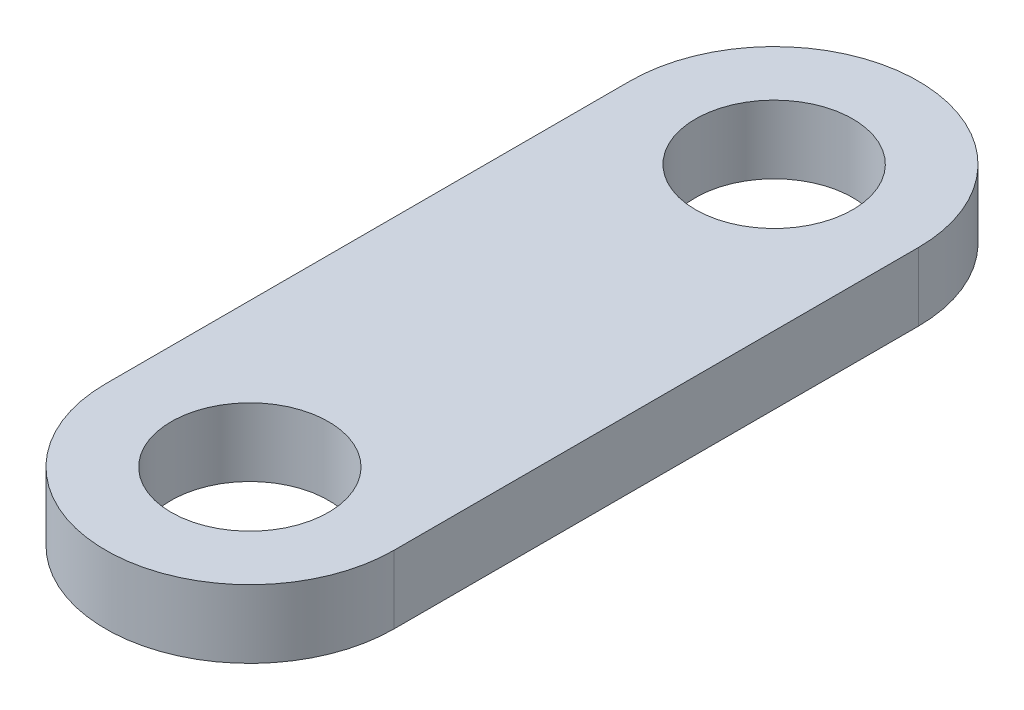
ISO-10303-21;
HEADER;
FILE_DESCRIPTION(('STEP AP214'),'2;1');
FILE_NAME('part.step','',(''),(''),'','','');
FILE_SCHEMA(('AUTOMOTIVE_DESIGN { 1 0 10303 214 1 1 1 1 }'));
ENDSEC;
DATA;
#1=APPLICATION_CONTEXT('core data for automotive mechanical design processes');
#2=APPLICATION_PROTOCOL_DEFINITION('international standard','automotive_design',2000,#1);
#3=PRODUCT_CONTEXT('',#1,'mechanical');
#4=PRODUCT('Part','Part','',(#3));
#5=PRODUCT_RELATED_PRODUCT_CATEGORY('part','',(#4));
#6=PRODUCT_DEFINITION_FORMATION('','',#4);
#7=PRODUCT_DEFINITION_CONTEXT('part definition',#1,'design');
#8=PRODUCT_DEFINITION('design','',#6,#7);
#9=PRODUCT_DEFINITION_SHAPE('','',#8);
#10=(LENGTH_UNIT() NAMED_UNIT(*) SI_UNIT(.MILLI.,.METRE.));
#11=(NAMED_UNIT(*) PLANE_ANGLE_UNIT() SI_UNIT($,.RADIAN.));
#12=(NAMED_UNIT(*) SI_UNIT($,.STERADIAN.) SOLID_ANGLE_UNIT());
#13=UNCERTAINTY_MEASURE_WITH_UNIT(LENGTH_MEASURE(1.E-05),#10,'distance_accuracy_value','');
#14=(GEOMETRIC_REPRESENTATION_CONTEXT(3) GLOBAL_UNCERTAINTY_ASSIGNED_CONTEXT((#13)) GLOBAL_UNIT_ASSIGNED_CONTEXT((#10,
#11,#12)) REPRESENTATION_CONTEXT('',''));
#15=CARTESIAN_POINT('',(0.,0.,0.));
#16=DIRECTION('',(0.,0.,1.));
#17=DIRECTION('',(1.,0.,0.));
#18=AXIS2_PLACEMENT_3D('',#15,#16,#17);
#19=CARTESIAN_POINT('',(0.,2.6,-10.2603383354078));
#20=DIRECTION('',(0.,1.,0.));
#21=DIRECTION('',(0.,0.,1.));
#22=AXIS2_PLACEMENT_3D('',#19,#20,#21);
#23=PLANE('',#22);
#24=CARTESIAN_POINT('',(0.,2.6,-10.2603383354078));
#25=DIRECTION('',(0.,1.,0.));
#26=DIRECTION('',(0.,0.,1.));
#27=AXIS2_PLACEMENT_3D('',#24,#25,#26);
#28=CIRCLE('',#27,3.);
#29=CARTESIAN_POINT('',(0.,2.6,-7.26033833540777));
#30=VERTEX_POINT('',#29);
#31=EDGE_CURVE('E117',#30,#30,#28,.T.);
#32=ORIENTED_EDGE('',*,*,#31,.F.);
#33=EDGE_LOOP('',(#32));
#34=FACE_BOUND('',#33,.T.);
#35=CARTESIAN_POINT('',(0.,2.6,-10.2603383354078));
#36=DIRECTION('',(0.,1.,0.));
#37=DIRECTION('',(0.,0.,1.));
#38=AXIS2_PLACEMENT_3D('',#35,#36,#37);
#39=CIRCLE('',#38,5.5);
#40=CARTESIAN_POINT('',(5.5,2.6,-10.2603383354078));
#41=VERTEX_POINT('',#40);
#42=CARTESIAN_POINT('',(-5.5,2.6,-10.2603383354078));
#43=VERTEX_POINT('',#42);
#44=EDGE_CURVE('E98',#41,#43,#39,.T.);
#45=ORIENTED_EDGE('',*,*,#44,.T.);
#46=DIRECTION('',(0.,0.,1.));
#47=VECTOR('',#46,1.);
#48=CARTESIAN_POINT('',(-5.5,2.6,-10.2603383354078));
#49=LINE('',#48,#47);
#50=CARTESIAN_POINT('',(-5.5,2.6,9.73966166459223));
#51=VERTEX_POINT('',#50);
#52=EDGE_CURVE('E91',#43,#51,#49,.T.);
#53=ORIENTED_EDGE('',*,*,#52,.T.);
#54=CARTESIAN_POINT('',(0.,2.6,9.73966166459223));
#55=DIRECTION('',(0.,1.,0.));
#56=DIRECTION('',(0.,0.,1.));
#57=AXIS2_PLACEMENT_3D('',#54,#55,#56);
#58=CIRCLE('',#57,5.5);
#59=CARTESIAN_POINT('',(5.5,2.6,9.73966166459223));
#60=VERTEX_POINT('',#59);
#61=EDGE_CURVE('E96',#51,#60,#58,.T.);
#62=ORIENTED_EDGE('',*,*,#61,.T.);
#63=DIRECTION('',(0.,0.,-1.));
#64=VECTOR('',#63,1.);
#65=CARTESIAN_POINT('',(5.5,2.6,9.73966166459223));
#66=LINE('',#65,#64);
#67=EDGE_CURVE('E62',#60,#41,#66,.T.);
#68=ORIENTED_EDGE('',*,*,#67,.T.);
#69=EDGE_LOOP('',(#45,#53,#62,#68));
#70=FACE_BOUND('',#69,.T.);
#71=CARTESIAN_POINT('',(0.,2.6,9.73966166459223));
#72=DIRECTION('',(0.,1.,0.));
#73=DIRECTION('',(0.,0.,1.));
#74=AXIS2_PLACEMENT_3D('',#71,#72,#73);
#75=CIRCLE('',#74,3.);
#76=CARTESIAN_POINT('',(0.,2.6,12.7396616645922));
#77=VERTEX_POINT('',#76);
#78=EDGE_CURVE('E138',#77,#77,#75,.T.);
#79=ORIENTED_EDGE('',*,*,#78,.F.);
#80=EDGE_LOOP('',(#79));
#81=FACE_BOUND('',#80,.T.);
#82=ADVANCED_FACE('F44',(#34,#70,#81),#23,.T.);
#83=CARTESIAN_POINT('',(0.,0.,-10.2603383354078));
#84=DIRECTION('',(0.,1.,0.));
#85=DIRECTION('',(0.,0.,1.));
#86=AXIS2_PLACEMENT_3D('',#83,#84,#85);
#87=PLANE('',#86);
#88=CARTESIAN_POINT('',(0.,0.,-10.2603383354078));
#89=DIRECTION('',(0.,1.,0.));
#90=DIRECTION('',(0.,0.,1.));
#91=AXIS2_PLACEMENT_3D('',#88,#89,#90);
#92=CIRCLE('',#91,5.5);
#93=CARTESIAN_POINT('',(5.5,0.,-10.2603383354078));
#94=VERTEX_POINT('',#93);
#95=CARTESIAN_POINT('',(-5.5,0.,-10.2603383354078));
#96=VERTEX_POINT('',#95);
#97=EDGE_CURVE('E111',#94,#96,#92,.T.);
#98=ORIENTED_EDGE('',*,*,#97,.F.);
#99=DIRECTION('',(0.,0.,-1.));
#100=VECTOR('',#99,1.);
#101=CARTESIAN_POINT('',(5.5,0.,9.73966166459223));
#102=LINE('',#101,#100);
#103=CARTESIAN_POINT('',(5.5,0.,9.73966166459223));
#104=VERTEX_POINT('',#103);
#105=EDGE_CURVE('E88',#104,#94,#102,.T.);
#106=ORIENTED_EDGE('',*,*,#105,.F.);
#107=CARTESIAN_POINT('',(0.,0.,9.73966166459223));
#108=DIRECTION('',(0.,1.,0.));
#109=DIRECTION('',(0.,0.,1.));
#110=AXIS2_PLACEMENT_3D('',#107,#108,#109);
#111=CIRCLE('',#110,5.5);
#112=CARTESIAN_POINT('',(-5.5,0.,9.73966166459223));
#113=VERTEX_POINT('',#112);
#114=EDGE_CURVE('E79',#113,#104,#111,.T.);
#115=ORIENTED_EDGE('',*,*,#114,.F.);
#116=DIRECTION('',(0.,0.,1.));
#117=VECTOR('',#116,1.);
#118=CARTESIAN_POINT('',(-5.5,0.,-10.2603383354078));
#119=LINE('',#118,#117);
#120=EDGE_CURVE('E103',#96,#113,#119,.T.);
#121=ORIENTED_EDGE('',*,*,#120,.F.);
#122=EDGE_LOOP('',(#98,#106,#115,#121));
#123=FACE_BOUND('',#122,.T.);
#124=CARTESIAN_POINT('',(0.,0.,-10.2603383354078));
#125=DIRECTION('',(0.,1.,0.));
#126=DIRECTION('',(0.,0.,1.));
#127=AXIS2_PLACEMENT_3D('',#124,#125,#126);
#128=CIRCLE('',#127,3.);
#129=CARTESIAN_POINT('',(0.,0.,-7.26033833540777));
#130=VERTEX_POINT('',#129);
#131=EDGE_CURVE('E137',#130,#130,#128,.T.);
#132=ORIENTED_EDGE('',*,*,#131,.T.);
#133=EDGE_LOOP('',(#132));
#134=FACE_BOUND('',#133,.T.);
#135=CARTESIAN_POINT('',(0.,0.,9.73966166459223));
#136=DIRECTION('',(0.,1.,0.));
#137=DIRECTION('',(0.,0.,1.));
#138=AXIS2_PLACEMENT_3D('',#135,#136,#137);
#139=CIRCLE('',#138,3.);
#140=CARTESIAN_POINT('',(0.,0.,12.7396616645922));
#141=VERTEX_POINT('',#140);
#142=EDGE_CURVE('E145',#141,#141,#139,.T.);
#143=ORIENTED_EDGE('',*,*,#142,.T.);
#144=EDGE_LOOP('',(#143));
#145=FACE_BOUND('',#144,.T.);
#146=ADVANCED_FACE('F131',(#123,#134,#145),#87,.F.);
#147=CARTESIAN_POINT('',(0.,2.6,-10.2603383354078));
#148=DIRECTION('',(0.,-1.,0.));
#149=DIRECTION('',(0.,0.,-1.));
#150=AXIS2_PLACEMENT_3D('',#147,#148,#149);
#151=CYLINDRICAL_SURFACE('',#150,5.5);
#152=ORIENTED_EDGE('',*,*,#97,.T.);
#153=DIRECTION('',(0.,-1.,0.));
#154=VECTOR('',#153,1.);
#155=CARTESIAN_POINT('',(-5.5,2.6,-10.2603383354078));
#156=LINE('',#155,#154);
#157=EDGE_CURVE('E11',#43,#96,#156,.T.);
#158=ORIENTED_EDGE('',*,*,#157,.F.);
#159=ORIENTED_EDGE('',*,*,#44,.F.);
#160=DIRECTION('',(0.,-1.,0.));
#161=VECTOR('',#160,1.);
#162=CARTESIAN_POINT('',(5.5,2.6,-10.2603383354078));
#163=LINE('',#162,#161);
#164=EDGE_CURVE('E109',#41,#94,#163,.T.);
#165=ORIENTED_EDGE('',*,*,#164,.T.);
#166=EDGE_LOOP('',(#152,#158,#159,#165));
#167=FACE_BOUND('',#166,.T.);
#168=ADVANCED_FACE('F50',(#167),#151,.T.);
#169=CARTESIAN_POINT('',(-5.5,2.6,-10.2603383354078));
#170=DIRECTION('',(1.,0.,0.));
#171=DIRECTION('',(0.,0.,-1.));
#172=AXIS2_PLACEMENT_3D('',#169,#170,#171);
#173=PLANE('',#172);
#174=ORIENTED_EDGE('',*,*,#120,.T.);
#175=DIRECTION('',(0.,-1.,0.));
#176=VECTOR('',#175,1.);
#177=CARTESIAN_POINT('',(-5.5,2.6,9.73966166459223));
#178=LINE('',#177,#176);
#179=EDGE_CURVE('E54',#51,#113,#178,.T.);
#180=ORIENTED_EDGE('',*,*,#179,.F.);
#181=ORIENTED_EDGE('',*,*,#52,.F.);
#182=ORIENTED_EDGE('',*,*,#157,.T.);
#183=EDGE_LOOP('',(#174,#180,#181,#182));
#184=FACE_BOUND('',#183,.T.);
#185=ADVANCED_FACE('F105',(#184),#173,.F.);
#186=CARTESIAN_POINT('',(0.,2.6,9.73966166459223));
#187=DIRECTION('',(0.,-1.,0.));
#188=DIRECTION('',(0.,0.,-1.));
#189=AXIS2_PLACEMENT_3D('',#186,#187,#188);
#190=CYLINDRICAL_SURFACE('',#189,5.5);
#191=ORIENTED_EDGE('',*,*,#114,.T.);
#192=DIRECTION('',(0.,-1.,0.));
#193=VECTOR('',#192,1.);
#194=CARTESIAN_POINT('',(5.5,2.6,9.73966166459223));
#195=LINE('',#194,#193);
#196=EDGE_CURVE('E104',#60,#104,#195,.T.);
#197=ORIENTED_EDGE('',*,*,#196,.F.);
#198=ORIENTED_EDGE('',*,*,#61,.F.);
#199=ORIENTED_EDGE('',*,*,#179,.T.);
#200=EDGE_LOOP('',(#191,#197,#198,#199));
#201=FACE_BOUND('',#200,.T.);
#202=ADVANCED_FACE('F106',(#201),#190,.T.);
#203=CARTESIAN_POINT('',(5.5,2.6,9.73966166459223));
#204=DIRECTION('',(-1.,0.,0.));
#205=DIRECTION('',(0.,0.,1.));
#206=AXIS2_PLACEMENT_3D('',#203,#204,#205);
#207=PLANE('',#206);
#208=ORIENTED_EDGE('',*,*,#105,.T.);
#209=ORIENTED_EDGE('',*,*,#164,.F.);
#210=ORIENTED_EDGE('',*,*,#67,.F.);
#211=ORIENTED_EDGE('',*,*,#196,.T.);
#212=EDGE_LOOP('',(#208,#209,#210,#211));
#213=FACE_BOUND('',#212,.T.);
#214=ADVANCED_FACE('F126',(#213),#207,.F.);
#215=CARTESIAN_POINT('',(0.,2.6,-10.2603383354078));
#216=DIRECTION('',(0.,-1.,0.));
#217=DIRECTION('',(0.,0.,-1.));
#218=AXIS2_PLACEMENT_3D('',#215,#216,#217);
#219=CYLINDRICAL_SURFACE('',#218,3.);
#220=ORIENTED_EDGE('',*,*,#31,.T.);
#221=EDGE_LOOP('',(#220));
#222=FACE_BOUND('',#221,.T.);
#223=ORIENTED_EDGE('',*,*,#131,.F.);
#224=EDGE_LOOP('',(#223));
#225=FACE_BOUND('',#224,.T.);
#226=ADVANCED_FACE('F162',(#222,#225),#219,.F.);
#227=CARTESIAN_POINT('',(0.,2.6,9.73966166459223));
#228=DIRECTION('',(0.,-1.,0.));
#229=DIRECTION('',(0.,0.,-1.));
#230=AXIS2_PLACEMENT_3D('',#227,#228,#229);
#231=CYLINDRICAL_SURFACE('',#230,3.);
#232=ORIENTED_EDGE('',*,*,#78,.T.);
#233=EDGE_LOOP('',(#232));
#234=FACE_BOUND('',#233,.T.);
#235=ORIENTED_EDGE('',*,*,#142,.F.);
#236=EDGE_LOOP('',(#235));
#237=FACE_BOUND('',#236,.T.);
#238=ADVANCED_FACE('F155',(#234,#237),#231,.F.);
#239=CLOSED_SHELL('',(#82,#146,#168,#185,#202,#214,#226,#238));
#240=MANIFOLD_SOLID_BREP('B2',#239);
#241=ADVANCED_BREP_SHAPE_REPRESENTATION('',(#18,#240),#14);
#242=SHAPE_DEFINITION_REPRESENTATION(#9,#241);
ENDSEC;
END-ISO-10303-21;
